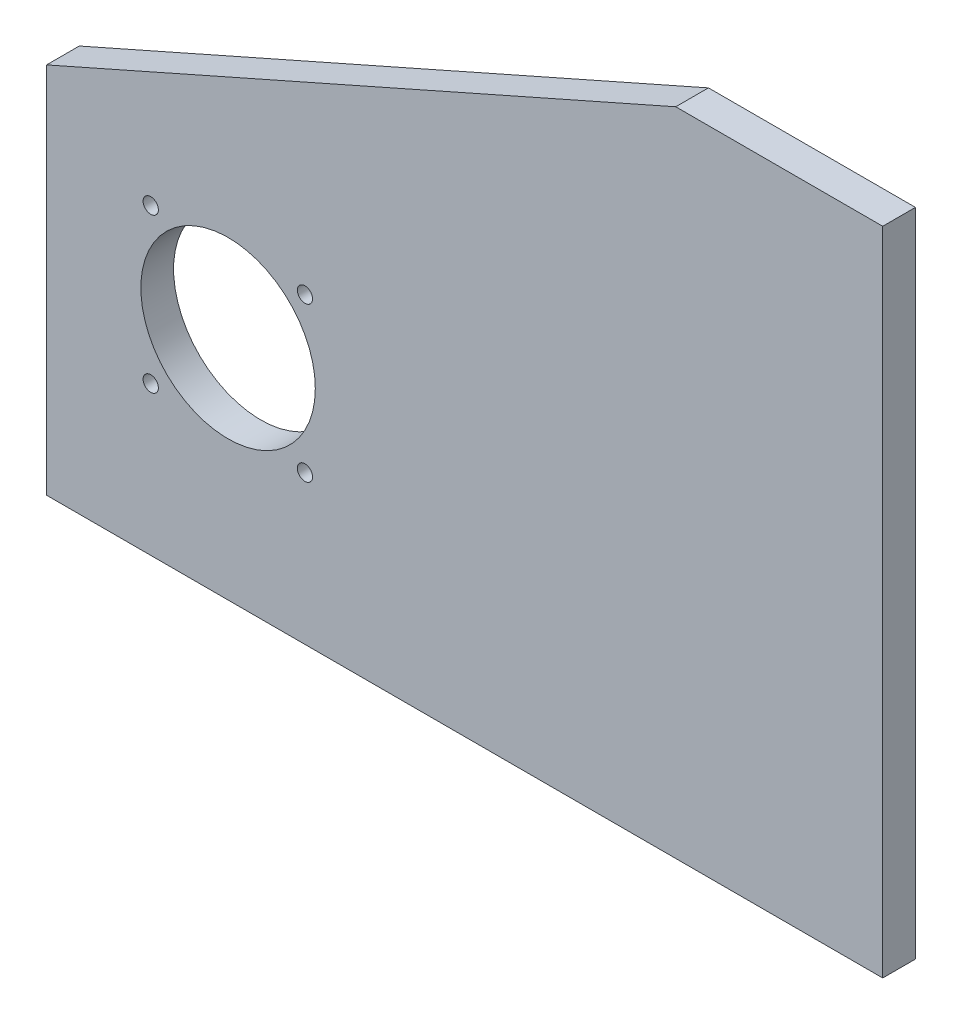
from build123d import *

# Parameters (mm, degrees)
ESQUISSE1_R          = 40
ESQUISSE1_R_2        = 3.5
ESQUISSE1_R_3        = 3.479667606
BASE_EXTRUSION_DEPTH = 15


with BuildPart() as part:
    # Esquisse1 → Base-Extrusion (new body)
    with BuildSketch(Plane.XY):
        Polygon((-2468.720119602, 3722.316493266), (-2757.221099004, 3594.690547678), (-2757.221099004, 3423.7932706), (-2499.880972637, 3423.7932706), (-2373.801729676, 3423.7932706), (-2373.801729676, 3722.316493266), align=None)
        with Locations((-2673.986508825, 3527.7932706)):
            Circle(ESQUISSE1_R, mode=Mode.SUBTRACT)
        with Locations((-2709.452270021, 3492.03798252)):
            Circle(ESQUISSE1_R_2, mode=Mode.SUBTRACT)
        with Locations((-2709.452270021, 3562.748660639)):
            Circle(ESQUISSE1_R_2, mode=Mode.SUBTRACT)
        with Locations((-2638.727208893, 3562.734271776)):
            Circle(ESQUISSE1_R_3, mode=Mode.SUBTRACT)
        with Locations((-2638.741591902, 3492.03798252)):
            Circle(ESQUISSE1_R_2, mode=Mode.SUBTRACT)
    extrude(amount=BASE_EXTRUSION_DEPTH)


solid = part.part
